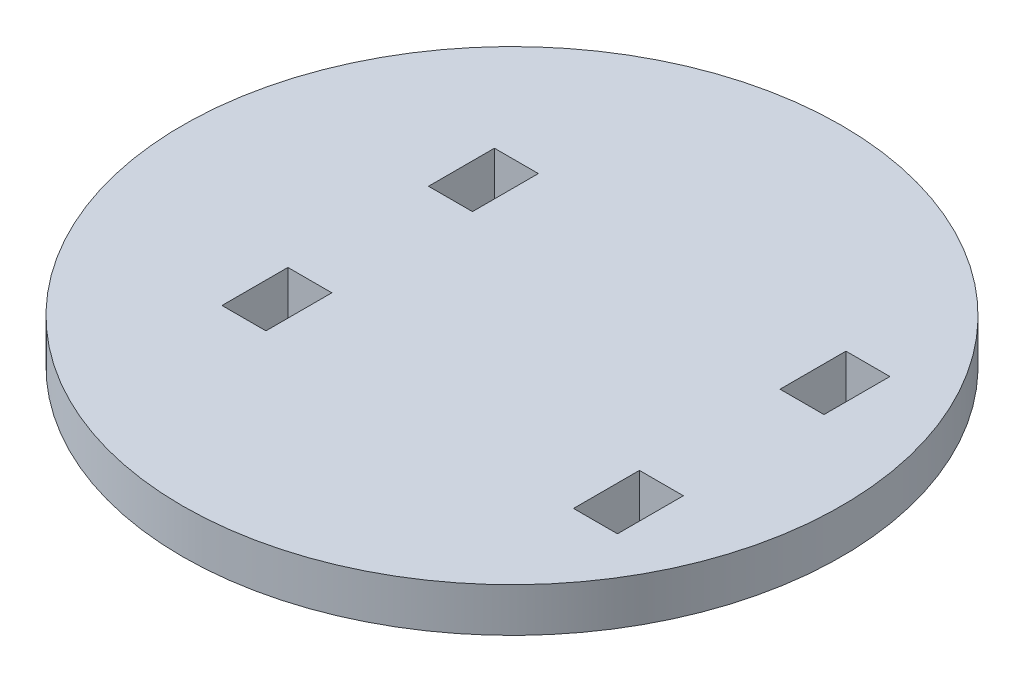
from build123d import *

# Parameters (mm, degrees)
SKETCH2_R           = 37.5
BOSS_EXTRUDE1_DEPTH = 5
SKETCH3_R           = 0.5
CUT_EXTRUDE1_DEPTH  = 1
SKETCH4_W           = 5
SKETCH4_H           = 7.5
CUT_EXTRUDE2_DEPTH  = 10


with BuildPart() as part:
    # Sketch2 → Boss-Extrude1 (new body)
    with BuildSketch(Plane(origin=(0, 0, 0), x_dir=(1, 0, 0), z_dir=(0, 1, 0))):
        with Locations(Location((0, 0, 0), (0, 0, 270))):
            Circle(SKETCH2_R)
    extrude(amount=BOSS_EXTRUDE1_DEPTH)

    # Sketch3 → Cut-Extrude1 (cut)
    with BuildSketch(Plane.XZ):
        with Locations(Location((0, 11, 0), (0, 0, 270))):
            Circle(SKETCH3_R)
        with Locations(Location((0, 15, 0), (0, 0, 270))):
            Circle(SKETCH3_R)
        with Locations(Location((0, 0, 0), (0, 0, 270))):
            Circle(SKETCH3_R)
    extrude(amount=-CUT_EXTRUDE1_DEPTH, mode=Mode.SUBTRACT)

    # Sketch4 → Cut-Extrude2 (cut)
    with BuildSketch(Plane(origin=(0, 5, 0), x_dir=(1, 0, 0), z_dir=(0, 1, 0))):
        with Locations((-15, 11.75)):
            Rectangle(SKETCH4_W, SKETCH4_H)
        with Locations((25, 11.75)):
            Rectangle(SKETCH4_W, SKETCH4_H)
        with Locations((-15, -11.75)):
            Rectangle(SKETCH4_W, SKETCH4_H)
        with Locations((25, -11.75)):
            Rectangle(SKETCH4_W, SKETCH4_H)
    extrude(amount=-CUT_EXTRUDE2_DEPTH, mode=Mode.SUBTRACT)


solid = part.part
